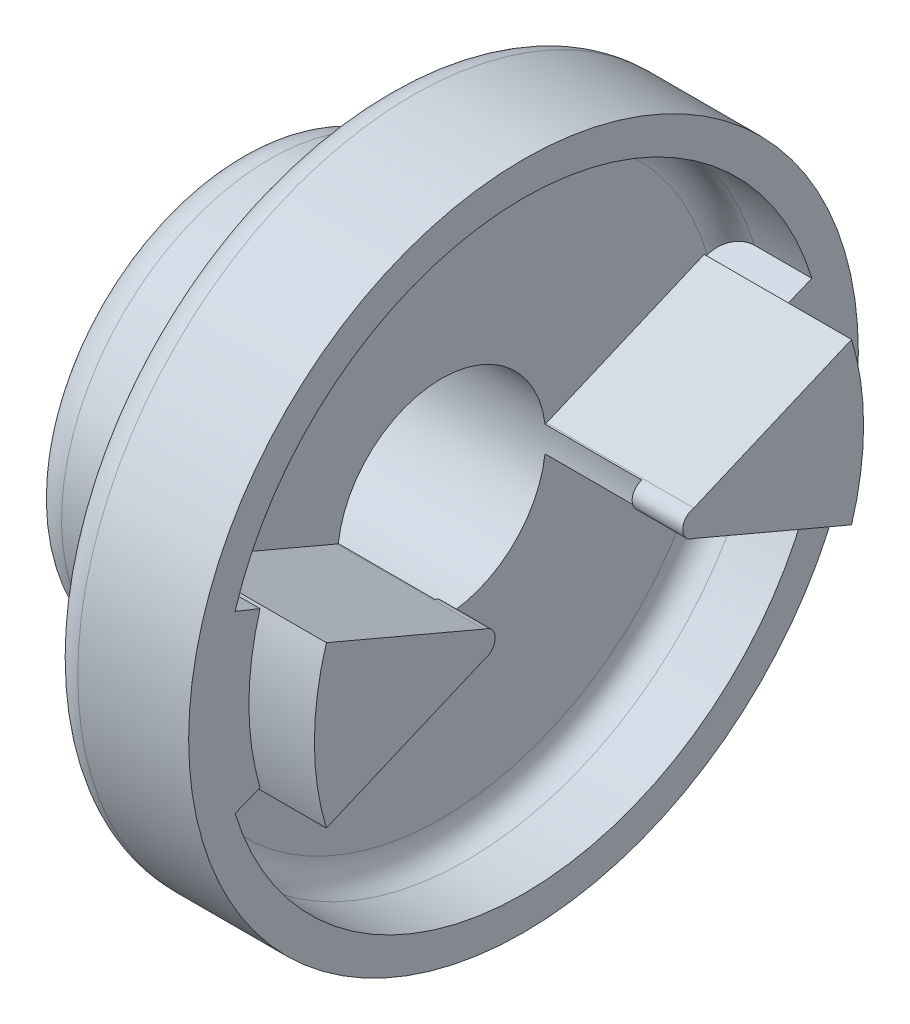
ISO-10303-21;
HEADER;
FILE_DESCRIPTION(('STEP AP214'),'2;1');
FILE_NAME('part.step','',(''),(''),'','','');
FILE_SCHEMA(('AUTOMOTIVE_DESIGN { 1 0 10303 214 1 1 1 1 }'));
ENDSEC;
DATA;
#1=APPLICATION_CONTEXT('core data for automotive mechanical design processes');
#2=APPLICATION_PROTOCOL_DEFINITION('international standard','automotive_design',2000,#1);
#3=PRODUCT_CONTEXT('',#1,'mechanical');
#4=PRODUCT('Part','Part','',(#3));
#5=PRODUCT_RELATED_PRODUCT_CATEGORY('part','',(#4));
#6=PRODUCT_DEFINITION_FORMATION('','',#4);
#7=PRODUCT_DEFINITION_CONTEXT('part definition',#1,'design');
#8=PRODUCT_DEFINITION('design','',#6,#7);
#9=PRODUCT_DEFINITION_SHAPE('','',#8);
#10=(LENGTH_UNIT() NAMED_UNIT(*) SI_UNIT(.MILLI.,.METRE.));
#11=(NAMED_UNIT(*) PLANE_ANGLE_UNIT() SI_UNIT($,.RADIAN.));
#12=(NAMED_UNIT(*) SI_UNIT($,.STERADIAN.) SOLID_ANGLE_UNIT());
#13=UNCERTAINTY_MEASURE_WITH_UNIT(LENGTH_MEASURE(1.E-05),#10,'distance_accuracy_value','');
#14=(GEOMETRIC_REPRESENTATION_CONTEXT(3) GLOBAL_UNCERTAINTY_ASSIGNED_CONTEXT((#13)) GLOBAL_UNIT_ASSIGNED_CONTEXT((#10,
#11,#12)) REPRESENTATION_CONTEXT('',''));
#15=CARTESIAN_POINT('',(0.,0.,0.));
#16=DIRECTION('',(0.,0.,1.));
#17=DIRECTION('',(1.,0.,0.));
#18=AXIS2_PLACEMENT_3D('',#15,#16,#17);
#19=CARTESIAN_POINT('',(-20.5,0.,5.77));
#20=DIRECTION('',(-1.,0.,0.));
#21=DIRECTION('',(0.,0.,1.));
#22=AXIS2_PLACEMENT_3D('',#19,#20,#21);
#23=PLANE('',#22);
#24=CARTESIAN_POINT('',(-20.5,0.,0.));
#25=DIRECTION('',(1.,0.,0.));
#26=DIRECTION('',(0.,0.,-1.));
#27=AXIS2_PLACEMENT_3D('',#24,#25,#26);
#28=CIRCLE('',#27,7.);
#29=CARTESIAN_POINT('',(-20.5,0.,-7.));
#30=VERTEX_POINT('',#29);
#31=EDGE_CURVE('E214',#30,#30,#28,.T.);
#32=ORIENTED_EDGE('',*,*,#31,.T.);
#33=EDGE_LOOP('',(#32));
#34=FACE_BOUND('',#33,.T.);
#35=CARTESIAN_POINT('',(-20.5,0.,0.));
#36=DIRECTION('',(1.,0.,0.));
#37=DIRECTION('',(0.,-1.,0.));
#38=AXIS2_PLACEMENT_3D('',#35,#36,#37);
#39=CIRCLE('',#38,11.54);
#40=CARTESIAN_POINT('',(-20.5,-11.54,0.));
#41=VERTEX_POINT('',#40);
#42=CARTESIAN_POINT('',(-20.5,11.54,0.));
#43=VERTEX_POINT('',#42);
#44=EDGE_CURVE('E390',#41,#43,#39,.T.);
#45=ORIENTED_EDGE('',*,*,#44,.F.);
#46=CARTESIAN_POINT('',(-20.5,0.,0.));
#47=DIRECTION('',(1.,0.,0.));
#48=DIRECTION('',(0.,0.,1.));
#49=AXIS2_PLACEMENT_3D('',#46,#47,#48);
#50=CIRCLE('',#49,11.54);
#51=CARTESIAN_POINT('',(-20.5,0.,11.54));
#52=VERTEX_POINT('',#51);
#53=EDGE_CURVE('E189',#52,#41,#50,.T.);
#54=ORIENTED_EDGE('',*,*,#53,.F.);
#55=CARTESIAN_POINT('',(-20.5,0.,0.));
#56=DIRECTION('',(1.,0.,0.));
#57=DIRECTION('',(0.,1.,0.));
#58=AXIS2_PLACEMENT_3D('',#55,#56,#57);
#59=CIRCLE('',#58,11.54);
#60=EDGE_CURVE('E393',#43,#52,#59,.T.);
#61=ORIENTED_EDGE('',*,*,#60,.F.);
#62=EDGE_LOOP('',(#45,#54,#61));
#63=FACE_BOUND('',#62,.T.);
#64=ADVANCED_FACE('F16',(#34,#63),#23,.T.);
#65=CARTESIAN_POINT('',(-18.04,0.,0.));
#66=DIRECTION('',(-1.,0.,0.));
#67=DIRECTION('',(0.,-1.,0.));
#68=AXIS2_PLACEMENT_3D('',#65,#66,#67);
#69=TOROIDAL_SURFACE('',#68,11.54,2.46);
#70=CARTESIAN_POINT('',(-18.04,0.,0.));
#71=DIRECTION('',(-1.,0.,0.));
#72=DIRECTION('',(0.,-1.,0.));
#73=AXIS2_PLACEMENT_3D('',#70,#71,#72);
#74=CIRCLE('',#73,14.);
#75=CARTESIAN_POINT('',(-18.04,-14.,0.));
#76=VERTEX_POINT('',#75);
#77=EDGE_CURVE('E211',#76,#76,#74,.F.);
#78=ORIENTED_EDGE('',*,*,#77,.F.);
#79=EDGE_LOOP('',(#78));
#80=FACE_BOUND('',#79,.T.);
#81=ORIENTED_EDGE('',*,*,#60,.T.);
#82=ORIENTED_EDGE('',*,*,#53,.T.);
#83=ORIENTED_EDGE('',*,*,#44,.T.);
#84=EDGE_LOOP('',(#81,#82,#83));
#85=FACE_BOUND('',#84,.T.);
#86=ADVANCED_FACE('F226',(#80,#85),#69,.T.);
#87=CARTESIAN_POINT('',(0.,0.,0.));
#88=DIRECTION('',(1.,0.,0.));
#89=DIRECTION('',(0.,0.,-1.));
#90=AXIS2_PLACEMENT_3D('',#87,#88,#89);
#91=PLANE('',#90);
#92=CARTESIAN_POINT('',(0.,0.,0.));
#93=DIRECTION('',(1.,0.,0.));
#94=DIRECTION('',(0.,0.,-1.));
#95=AXIS2_PLACEMENT_3D('',#92,#93,#94);
#96=CIRCLE('',#95,7.);
#97=CARTESIAN_POINT('',(0.,-0.863569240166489,6.94652777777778));
#98=VERTEX_POINT('',#97);
#99=CARTESIAN_POINT('',(0.,0.863569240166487,6.94652777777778));
#100=VERTEX_POINT('',#99);
#101=EDGE_CURVE('E188',#98,#100,#96,.F.);
#102=ORIENTED_EDGE('',*,*,#101,.T.);
#103=CARTESIAN_POINT('',(0.,0.,7.2));
#104=DIRECTION('',(-1.,0.,0.));
#105=DIRECTION('',(0.,-1.,0.));
#106=AXIS2_PLACEMENT_3D('',#103,#104,#105);
#107=CIRCLE('',#106,0.9);
#108=EDGE_CURVE('E580',#98,#100,#107,.F.);
#109=ORIENTED_EDGE('',*,*,#108,.F.);
#110=EDGE_LOOP('',(#102,#109));
#111=FACE_BOUND('',#110,.T.);
#112=ADVANCED_FACE('F237',(#111),#91,.F.);
#113=CARTESIAN_POINT('',(0.,0.,0.));
#114=DIRECTION('',(1.,0.,0.));
#115=DIRECTION('',(0.,0.,-1.));
#116=AXIS2_PLACEMENT_3D('',#113,#114,#115);
#117=PLANE('',#116);
#118=CARTESIAN_POINT('',(0.,0.,-7.2));
#119=DIRECTION('',(-1.,0.,0.));
#120=DIRECTION('',(0.,-1.,0.));
#121=AXIS2_PLACEMENT_3D('',#118,#119,#120);
#122=CIRCLE('',#121,0.9);
#123=CARTESIAN_POINT('',(0.,0.86356924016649,-6.94652777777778));
#124=VERTEX_POINT('',#123);
#125=CARTESIAN_POINT('',(0.,-0.863569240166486,-6.94652777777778));
#126=VERTEX_POINT('',#125);
#127=EDGE_CURVE('E191',#124,#126,#122,.F.);
#128=ORIENTED_EDGE('',*,*,#127,.F.);
#129=CARTESIAN_POINT('',(0.,0.,0.));
#130=DIRECTION('',(1.,0.,0.));
#131=DIRECTION('',(0.,0.,-1.));
#132=AXIS2_PLACEMENT_3D('',#129,#130,#131);
#133=CIRCLE('',#132,7.);
#134=EDGE_CURVE('E177',#124,#126,#133,.F.);
#135=ORIENTED_EDGE('',*,*,#134,.T.);
#136=EDGE_LOOP('',(#128,#135));
#137=FACE_BOUND('',#136,.T.);
#138=ADVANCED_FACE('F192',(#137),#117,.F.);
#139=CARTESIAN_POINT('',(-12.3,0.,0.));
#140=DIRECTION('',(1.,0.,0.));
#141=DIRECTION('',(0.,0.,-1.));
#142=AXIS2_PLACEMENT_3D('',#139,#140,#141);
#143=CYLINDRICAL_SURFACE('',#142,7.);
#144=ORIENTED_EDGE('',*,*,#31,.F.);
#145=EDGE_LOOP('',(#144));
#146=FACE_BOUND('',#145,.T.);
#147=DIRECTION('',(-1.,0.,0.));
#148=VECTOR('',#147,1.);
#149=CARTESIAN_POINT('',(3.4,0.863569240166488,6.94652777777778));
#150=LINE('',#149,#148);
#151=CARTESIAN_POINT('',(-6.5,0.863569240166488,6.94652777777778));
#152=VERTEX_POINT('',#151);
#153=EDGE_CURVE('E208',#100,#152,#150,.T.);
#154=ORIENTED_EDGE('',*,*,#153,.F.);
#155=ORIENTED_EDGE('',*,*,#101,.F.);
#156=DIRECTION('',(-1.,0.,0.));
#157=VECTOR('',#156,1.);
#158=CARTESIAN_POINT('',(3.4,-0.863569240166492,6.94652777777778));
#159=LINE('',#158,#157);
#160=CARTESIAN_POINT('',(-6.5,-0.86356924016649,6.94652777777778));
#161=VERTEX_POINT('',#160);
#162=EDGE_CURVE('E206',#161,#98,#159,.F.);
#163=ORIENTED_EDGE('',*,*,#162,.F.);
#164=CARTESIAN_POINT('',(-6.5,0.,0.));
#165=DIRECTION('',(1.,0.,0.));
#166=DIRECTION('',(0.,0.,-1.));
#167=AXIS2_PLACEMENT_3D('',#164,#165,#166);
#168=CIRCLE('',#167,7.);
#169=CARTESIAN_POINT('',(-6.5,-0.863569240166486,-6.94652777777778));
#170=VERTEX_POINT('',#169);
#171=EDGE_CURVE('E568',#170,#161,#168,.F.);
#172=ORIENTED_EDGE('',*,*,#171,.F.);
#173=DIRECTION('',(-1.,0.,0.));
#174=VECTOR('',#173,1.);
#175=CARTESIAN_POINT('',(3.4,-0.863569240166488,-6.94652777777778));
#176=LINE('',#175,#174);
#177=EDGE_CURVE('E185',#126,#170,#176,.T.);
#178=ORIENTED_EDGE('',*,*,#177,.F.);
#179=ORIENTED_EDGE('',*,*,#134,.F.);
#180=DIRECTION('',(-1.,0.,0.));
#181=VECTOR('',#180,1.);
#182=CARTESIAN_POINT('',(3.4,0.863569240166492,-6.94652777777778));
#183=LINE('',#182,#181);
#184=CARTESIAN_POINT('',(-6.5,0.863569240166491,-6.94652777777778));
#185=VERTEX_POINT('',#184);
#186=EDGE_CURVE('E182',#185,#124,#183,.F.);
#187=ORIENTED_EDGE('',*,*,#186,.F.);
#188=CARTESIAN_POINT('',(-6.5,0.,0.));
#189=DIRECTION('',(1.,0.,0.));
#190=DIRECTION('',(0.,0.,-1.));
#191=AXIS2_PLACEMENT_3D('',#188,#189,#190);
#192=CIRCLE('',#191,7.);
#193=EDGE_CURVE('E578',#152,#185,#192,.F.);
#194=ORIENTED_EDGE('',*,*,#193,.F.);
#195=EDGE_LOOP('',(#154,#155,#163,#172,#178,#179,#187,#194));
#196=FACE_BOUND('',#195,.T.);
#197=ADVANCED_FACE('F180',(#146,#196),#143,.F.);
#198=CARTESIAN_POINT('',(-15.295,0.,0.));
#199=DIRECTION('',(-1.,0.,0.));
#200=DIRECTION('',(0.,-1.,0.));
#201=AXIS2_PLACEMENT_3D('',#198,#199,#200);
#202=CYLINDRICAL_SURFACE('',#201,14.);
#203=CARTESIAN_POINT('',(-12.55,0.,0.));
#204=DIRECTION('',(1.,0.,0.));
#205=DIRECTION('',(0.,1.,0.));
#206=AXIS2_PLACEMENT_3D('',#203,#204,#205);
#207=CIRCLE('',#206,14.);
#208=CARTESIAN_POINT('',(-12.55,14.,0.));
#209=VERTEX_POINT('',#208);
#210=EDGE_CURVE('E597',#209,#209,#207,.T.);
#211=ORIENTED_EDGE('',*,*,#210,.F.);
#212=EDGE_LOOP('',(#211));
#213=FACE_BOUND('',#212,.T.);
#214=ORIENTED_EDGE('',*,*,#77,.T.);
#215=EDGE_LOOP('',(#214));
#216=FACE_BOUND('',#215,.T.);
#217=ADVANCED_FACE('F649',(#213,#216),#202,.T.);
#218=CARTESIAN_POINT('',(3.4,0.,7.2));
#219=DIRECTION('',(-1.,0.,0.));
#220=DIRECTION('',(0.,-1.,0.));
#221=AXIS2_PLACEMENT_3D('',#218,#219,#220);
#222=CYLINDRICAL_SURFACE('',#221,0.9);
#223=ORIENTED_EDGE('',*,*,#162,.T.);
#224=ORIENTED_EDGE('',*,*,#108,.T.);
#225=ORIENTED_EDGE('',*,*,#153,.T.);
#226=CARTESIAN_POINT('',(-6.5,0.,7.2));
#227=DIRECTION('',(-1.,0.,0.));
#228=DIRECTION('',(0.,-1.,0.));
#229=AXIS2_PLACEMENT_3D('',#226,#227,#228);
#230=CIRCLE('',#229,0.9);
#231=CARTESIAN_POINT('',(-6.5,0.886326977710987,7.04371664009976));
#232=VERTEX_POINT('',#231);
#233=EDGE_CURVE('E199',#232,#152,#230,.T.);
#234=ORIENTED_EDGE('',*,*,#233,.F.);
#235=DIRECTION('',(1.,0.,0.));
#236=VECTOR('',#235,1.);
#237=CARTESIAN_POINT('',(3.4,0.886326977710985,7.04371664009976));
#238=LINE('',#237,#236);
#239=CARTESIAN_POINT('',(3.4,0.886326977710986,7.04371664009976));
#240=VERTEX_POINT('',#239);
#241=EDGE_CURVE('E605',#240,#232,#238,.F.);
#242=ORIENTED_EDGE('',*,*,#241,.F.);
#243=CARTESIAN_POINT('',(3.4,0.,7.2));
#244=DIRECTION('',(-1.,0.,0.));
#245=DIRECTION('',(0.,-1.,0.));
#246=AXIS2_PLACEMENT_3D('',#243,#244,#245);
#247=CIRCLE('',#246,0.9);
#248=CARTESIAN_POINT('',(3.4,-0.886326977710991,7.04371664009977));
#249=VERTEX_POINT('',#248);
#250=EDGE_CURVE('E266',#240,#249,#247,.T.);
#251=ORIENTED_EDGE('',*,*,#250,.T.);
#252=DIRECTION('',(1.,0.,0.));
#253=VECTOR('',#252,1.);
#254=CARTESIAN_POINT('',(3.4,-0.886326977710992,7.04371664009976));
#255=LINE('',#254,#253);
#256=CARTESIAN_POINT('',(-6.5,-0.886326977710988,7.04371664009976));
#257=VERTEX_POINT('',#256);
#258=EDGE_CURVE('E602',#257,#249,#255,.T.);
#259=ORIENTED_EDGE('',*,*,#258,.F.);
#260=CARTESIAN_POINT('',(-6.5,0.,7.2));
#261=DIRECTION('',(-1.,0.,0.));
#262=DIRECTION('',(0.,-1.,0.));
#263=AXIS2_PLACEMENT_3D('',#260,#261,#262);
#264=CIRCLE('',#263,0.9);
#265=EDGE_CURVE('E566',#161,#257,#264,.T.);
#266=ORIENTED_EDGE('',*,*,#265,.F.);
#267=EDGE_LOOP('',(#223,#224,#225,#234,#242,#251,#259,#266));
#268=FACE_BOUND('',#267,.T.);
#269=ADVANCED_FACE('F589',(#268),#222,.T.);
#270=CARTESIAN_POINT('',(-6.5,0.,9.305));
#271=DIRECTION('',(1.,0.,0.));
#272=DIRECTION('',(0.,0.,-1.));
#273=AXIS2_PLACEMENT_3D('',#270,#271,#272);
#274=PLANE('',#273);
#275=DIRECTION('',(0.,0.391352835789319,0.920240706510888));
#276=VECTOR('',#275,1.);
#277=CARTESIAN_POINT('',(-6.5,0.886326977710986,7.04371664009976));
#278=LINE('',#277,#276);
#279=CARTESIAN_POINT('',(-6.5,5.3942579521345,17.643822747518));
#280=VERTEX_POINT('',#279);
#281=EDGE_CURVE('E265',#232,#280,#278,.T.);
#282=ORIENTED_EDGE('',*,*,#281,.F.);
#283=ORIENTED_EDGE('',*,*,#233,.T.);
#284=ORIENTED_EDGE('',*,*,#193,.T.);
#285=CARTESIAN_POINT('',(-6.5,0.,-7.2));
#286=DIRECTION('',(-1.,0.,0.));
#287=DIRECTION('',(0.,-1.,0.));
#288=AXIS2_PLACEMENT_3D('',#285,#286,#287);
#289=CIRCLE('',#288,0.9);
#290=CARTESIAN_POINT('',(-6.5,0.88632697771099,-7.04371664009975));
#291=VERTEX_POINT('',#290);
#292=EDGE_CURVE('E198',#291,#185,#289,.F.);
#293=ORIENTED_EDGE('',*,*,#292,.F.);
#294=DIRECTION('',(0.,-0.391352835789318,0.920240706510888));
#295=VECTOR('',#294,1.);
#296=CARTESIAN_POINT('',(-6.5,5.3942579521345,-17.643822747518));
#297=LINE('',#296,#295);
#298=CARTESIAN_POINT('',(-6.5,5.3942579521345,-17.643822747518));
#299=VERTEX_POINT('',#298);
#300=EDGE_CURVE('E604',#299,#291,#297,.T.);
#301=ORIENTED_EDGE('',*,*,#300,.F.);
#302=CARTESIAN_POINT('',(-6.5,0.,0.));
#303=DIRECTION('',(1.,0.,0.));
#304=DIRECTION('',(0.,0.,-1.));
#305=AXIS2_PLACEMENT_3D('',#302,#303,#304);
#306=CIRCLE('',#305,18.45);
#307=CARTESIAN_POINT('',(-6.5,5.20360193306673,-17.7009894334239));
#308=VERTEX_POINT('',#307);
#309=EDGE_CURVE('E254',#299,#308,#306,.F.);
#310=ORIENTED_EDGE('',*,*,#309,.T.);
#311=DIRECTION('',(0.,0.375463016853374,-0.926837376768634));
#312=VECTOR('',#311,1.);
#313=CARTESIAN_POINT('',(-6.5,5.20360193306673,-17.7009894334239));
#314=LINE('',#313,#312);
#315=CARTESIAN_POINT('',(-6.5,5.26396892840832,-17.8500064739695));
#316=VERTEX_POINT('',#315);
#317=EDGE_CURVE('E252',#308,#316,#314,.T.);
#318=ORIENTED_EDGE('',*,*,#317,.T.);
#319=CARTESIAN_POINT('',(-6.49999999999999,0.,0.));
#320=DIRECTION('',(-1.,0.,0.));
#321=DIRECTION('',(0.,-1.,0.));
#322=AXIS2_PLACEMENT_3D('',#319,#320,#321);
#323=CIRCLE('',#322,18.61);
#324=CARTESIAN_POINT('',(-6.5,5.26396892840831,17.8500064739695));
#325=VERTEX_POINT('',#324);
#326=EDGE_CURVE('E517',#325,#316,#323,.T.);
#327=ORIENTED_EDGE('',*,*,#326,.F.);
#328=DIRECTION('',(0.,-0.37546301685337,-0.926837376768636));
#329=VECTOR('',#328,1.);
#330=CARTESIAN_POINT('',(-6.5,5.26396892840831,17.8500064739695));
#331=LINE('',#330,#329);
#332=CARTESIAN_POINT('',(-6.5,5.20360193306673,17.7009894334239));
#333=VERTEX_POINT('',#332);
#334=EDGE_CURVE('E249',#325,#333,#331,.T.);
#335=ORIENTED_EDGE('',*,*,#334,.T.);
#336=CARTESIAN_POINT('',(-6.5,0.,0.));
#337=DIRECTION('',(1.,0.,0.));
#338=DIRECTION('',(0.,0.,-1.));
#339=AXIS2_PLACEMENT_3D('',#336,#337,#338);
#340=CIRCLE('',#339,18.45);
#341=EDGE_CURVE('E202',#333,#280,#340,.F.);
#342=ORIENTED_EDGE('',*,*,#341,.T.);
#343=EDGE_LOOP('',(#282,#283,#284,#293,#301,#310,#318,#327,#335,#342));
#344=FACE_BOUND('',#343,.T.);
#345=ADVANCED_FACE('F642',(#344),#274,.T.);
#346=CARTESIAN_POINT('',(3.4,0.,-7.2));
#347=DIRECTION('',(-1.,0.,0.));
#348=DIRECTION('',(0.,-1.,0.));
#349=AXIS2_PLACEMENT_3D('',#346,#347,#348);
#350=CYLINDRICAL_SURFACE('',#349,0.9);
#351=DIRECTION('',(1.,0.,0.));
#352=VECTOR('',#351,1.);
#353=CARTESIAN_POINT('',(3.4,0.886326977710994,-7.04371664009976));
#354=LINE('',#353,#352);
#355=CARTESIAN_POINT('',(3.4,0.886326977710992,-7.04371664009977));
#356=VERTEX_POINT('',#355);
#357=EDGE_CURVE('E606',#291,#356,#354,.T.);
#358=ORIENTED_EDGE('',*,*,#357,.F.);
#359=ORIENTED_EDGE('',*,*,#292,.T.);
#360=ORIENTED_EDGE('',*,*,#186,.T.);
#361=ORIENTED_EDGE('',*,*,#127,.T.);
#362=ORIENTED_EDGE('',*,*,#177,.T.);
#363=CARTESIAN_POINT('',(-6.5,0.,-7.2));
#364=DIRECTION('',(-1.,0.,0.));
#365=DIRECTION('',(0.,-1.,0.));
#366=AXIS2_PLACEMENT_3D('',#363,#364,#365);
#367=CIRCLE('',#366,0.9);
#368=CARTESIAN_POINT('',(-6.5,-0.886326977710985,-7.04371664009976));
#369=VERTEX_POINT('',#368);
#370=EDGE_CURVE('E594',#369,#170,#367,.T.);
#371=ORIENTED_EDGE('',*,*,#370,.F.);
#372=DIRECTION('',(1.,0.,0.));
#373=VECTOR('',#372,1.);
#374=CARTESIAN_POINT('',(3.4,-0.886326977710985,-7.04371664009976));
#375=LINE('',#374,#373);
#376=CARTESIAN_POINT('',(3.4,-0.886326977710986,-7.04371664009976));
#377=VERTEX_POINT('',#376);
#378=EDGE_CURVE('E607',#377,#369,#375,.F.);
#379=ORIENTED_EDGE('',*,*,#378,.F.);
#380=CARTESIAN_POINT('',(3.4,0.,-7.2));
#381=DIRECTION('',(-1.,0.,0.));
#382=DIRECTION('',(0.,-1.,0.));
#383=AXIS2_PLACEMENT_3D('',#380,#381,#382);
#384=CIRCLE('',#383,0.9);
#385=EDGE_CURVE('E270',#377,#356,#384,.T.);
#386=ORIENTED_EDGE('',*,*,#385,.T.);
#387=EDGE_LOOP('',(#358,#359,#360,#361,#362,#371,#379,#386));
#388=FACE_BOUND('',#387,.T.);
#389=ADVANCED_FACE('F197',(#388),#350,.T.);
#390=CARTESIAN_POINT('',(-6.5,0.,9.305));
#391=DIRECTION('',(1.,0.,0.));
#392=DIRECTION('',(0.,0.,-1.));
#393=AXIS2_PLACEMENT_3D('',#390,#391,#392);
#394=PLANE('',#393);
#395=DIRECTION('',(0.,-0.391352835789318,-0.920240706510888));
#396=VECTOR('',#395,1.);
#397=CARTESIAN_POINT('',(-6.5,-0.886326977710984,-7.04371664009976));
#398=LINE('',#397,#396);
#399=CARTESIAN_POINT('',(-6.5,-5.39425795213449,-17.643822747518));
#400=VERTEX_POINT('',#399);
#401=EDGE_CURVE('E269',#369,#400,#398,.T.);
#402=ORIENTED_EDGE('',*,*,#401,.F.);
#403=ORIENTED_EDGE('',*,*,#370,.T.);
#404=ORIENTED_EDGE('',*,*,#171,.T.);
#405=ORIENTED_EDGE('',*,*,#265,.T.);
#406=DIRECTION('',(0.,0.391352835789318,-0.920240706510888));
#407=VECTOR('',#406,1.);
#408=CARTESIAN_POINT('',(-6.5,-5.39425795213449,17.643822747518));
#409=LINE('',#408,#407);
#410=CARTESIAN_POINT('',(-6.5,-5.39425795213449,17.643822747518));
#411=VERTEX_POINT('',#410);
#412=EDGE_CURVE('E563',#411,#257,#409,.T.);
#413=ORIENTED_EDGE('',*,*,#412,.F.);
#414=CARTESIAN_POINT('',(-6.5,0.,0.));
#415=DIRECTION('',(1.,0.,0.));
#416=DIRECTION('',(0.,0.,-1.));
#417=AXIS2_PLACEMENT_3D('',#414,#415,#416);
#418=CIRCLE('',#417,18.45);
#419=CARTESIAN_POINT('',(-6.5,-5.20360193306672,17.7009894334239));
#420=VERTEX_POINT('',#419);
#421=EDGE_CURVE('E262',#411,#420,#418,.F.);
#422=ORIENTED_EDGE('',*,*,#421,.T.);
#423=DIRECTION('',(0.,-0.375463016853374,0.926837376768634));
#424=VECTOR('',#423,1.);
#425=CARTESIAN_POINT('',(-6.5,-5.20360193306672,17.7009894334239));
#426=LINE('',#425,#424);
#427=CARTESIAN_POINT('',(-6.5,-5.26396892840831,17.8500064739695));
#428=VERTEX_POINT('',#427);
#429=EDGE_CURVE('E259',#420,#428,#426,.T.);
#430=ORIENTED_EDGE('',*,*,#429,.T.);
#431=CARTESIAN_POINT('',(-6.5,0.,0.));
#432=DIRECTION('',(-1.,0.,0.));
#433=DIRECTION('',(0.,-1.,0.));
#434=AXIS2_PLACEMENT_3D('',#431,#432,#433);
#435=CIRCLE('',#434,18.61);
#436=CARTESIAN_POINT('',(-6.5,-5.26396892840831,-17.8500064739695));
#437=VERTEX_POINT('',#436);
#438=EDGE_CURVE('E315',#437,#428,#435,.T.);
#439=ORIENTED_EDGE('',*,*,#438,.F.);
#440=DIRECTION('',(0.,0.37546301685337,0.926837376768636));
#441=VECTOR('',#440,1.);
#442=CARTESIAN_POINT('',(-6.5,-5.26396892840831,-17.8500064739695));
#443=LINE('',#442,#441);
#444=CARTESIAN_POINT('',(-6.5,-5.20360193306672,-17.7009894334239));
#445=VERTEX_POINT('',#444);
#446=EDGE_CURVE('E255',#437,#445,#443,.T.);
#447=ORIENTED_EDGE('',*,*,#446,.T.);
#448=CARTESIAN_POINT('',(-6.5,0.,0.));
#449=DIRECTION('',(1.,0.,0.));
#450=DIRECTION('',(0.,0.,-1.));
#451=AXIS2_PLACEMENT_3D('',#448,#449,#450);
#452=CIRCLE('',#451,18.45);
#453=EDGE_CURVE('E258',#445,#400,#452,.F.);
#454=ORIENTED_EDGE('',*,*,#453,.T.);
#455=EDGE_LOOP('',(#402,#403,#404,#405,#413,#422,#430,#439,#447,#454));
#456=FACE_BOUND('',#455,.T.);
#457=ADVANCED_FACE('F478',(#456),#394,.T.);
#458=CARTESIAN_POINT('',(-12.55,0.,0.));
#459=DIRECTION('',(-1.,0.,0.));
#460=DIRECTION('',(0.,-1.,0.));
#461=AXIS2_PLACEMENT_3D('',#458,#459,#460);
#462=TOROIDAL_SURFACE('',#461,16.05,2.05);
#463=CARTESIAN_POINT('',(-10.5,16.05,0.));
#464=CARTESIAN_POINT('',(-10.5,16.049951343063,1.47254158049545));
#465=CARTESIAN_POINT('',(-10.5,15.782051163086,2.92050699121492));
#466=CARTESIAN_POINT('',(-10.5,15.4980503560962,4.45549418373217));
#467=CARTESIAN_POINT('',(-10.5,14.923102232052,5.90792008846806));
#468=CARTESIAN_POINT('',(-10.5,14.3244040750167,7.42034299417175));
#469=CARTESIAN_POINT('',(-10.5,13.4337779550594,8.78271654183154));
#470=CARTESIAN_POINT('',(-10.5,12.5246371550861,10.1734116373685));
#471=CARTESIAN_POINT('',(-10.5,11.3490638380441,11.3490638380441));
#472=CARTESIAN_POINT('',(-10.5,10.1742479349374,12.5239585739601));
#473=CARTESIAN_POINT('',(-10.5,8.78271654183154,13.4337779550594));
#474=CARTESIAN_POINT('',(-10.5,7.42128005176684,14.3239205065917));
#475=CARTESIAN_POINT('',(-10.5,5.90792008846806,14.923102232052));
#476=CARTESIAN_POINT('',(-10.5,4.45650308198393,15.4977590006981));
#477=CARTESIAN_POINT('',(-10.5,2.92050699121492,15.782051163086));
#478=CARTESIAN_POINT('',(-10.5,1.47307488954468,16.0499513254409));
#479=CARTESIAN_POINT('',(-10.5,0.,16.05));
#480=B_SPLINE_CURVE_WITH_KNOTS('',2,(#463,#464,#465,#466,#467,#468,#469,#470,#471,#472,#473,
#474,#475,#476,#477,#478,#479),.UNSPECIFIED.,.F.,.F.,(3,2,2,2,2,2,2,2,3),(0.,0.125,0.25,0.375,
0.5,0.625,0.75,0.875,1.),.UNSPECIFIED.);
#481=CARTESIAN_POINT('',(-10.5,16.05,0.));
#482=VERTEX_POINT('',#481);
#483=CARTESIAN_POINT('',(-10.5,0.,16.05));
#484=VERTEX_POINT('',#483);
#485=EDGE_CURVE('E311',#482,#484,#480,.T.);
#486=ORIENTED_EDGE('',*,*,#485,.F.);
#487=CARTESIAN_POINT('',(-10.5,0.,0.));
#488=DIRECTION('',(-1.,0.,0.));
#489=DIRECTION('',(0.,-1.,0.));
#490=AXIS2_PLACEMENT_3D('',#487,#488,#489);
#491=CIRCLE('',#490,16.05);
#492=CARTESIAN_POINT('',(-10.5,-16.05,0.));
#493=VERTEX_POINT('',#492);
#494=EDGE_CURVE('E324',#493,#482,#491,.F.);
#495=ORIENTED_EDGE('',*,*,#494,.F.);
#496=CARTESIAN_POINT('',(-10.5,0.,16.05));
#497=CARTESIAN_POINT('',(-10.5,-1.47254158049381,16.0499513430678));
#498=CARTESIAN_POINT('',(-10.5,-2.92050699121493,15.782051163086));
#499=CARTESIAN_POINT('',(-10.5,-4.45549418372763,15.4980503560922));
#500=CARTESIAN_POINT('',(-10.5,-5.90792008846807,14.923102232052));
#501=CARTESIAN_POINT('',(-10.5,-7.42034299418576,14.3244040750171));
#502=CARTESIAN_POINT('',(-10.5,-8.78271654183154,13.4337779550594));
#503=CARTESIAN_POINT('',(-10.5,-10.1734116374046,12.5246371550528));
#504=CARTESIAN_POINT('',(-10.5,-11.3490638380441,11.3490638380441));
#505=CARTESIAN_POINT('',(-10.5,-12.5239585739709,10.1742479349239));
#506=CARTESIAN_POINT('',(-10.5,-13.4337779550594,8.78271654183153));
#507=CARTESIAN_POINT('',(-10.5,-14.3239205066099,7.4212800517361));
#508=CARTESIAN_POINT('',(-10.5,-14.923102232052,5.90792008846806));
#509=CARTESIAN_POINT('',(-10.5,-15.4977590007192,4.45650308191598));
#510=CARTESIAN_POINT('',(-10.5,-15.782051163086,2.92050699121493));
#511=CARTESIAN_POINT('',(-10.5,-16.0499513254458,1.47307488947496));
#512=CARTESIAN_POINT('',(-10.5,-16.05,0.));
#513=B_SPLINE_CURVE_WITH_KNOTS('',2,(#496,#497,#498,#499,#500,#501,#502,#503,#504,#505,#506,
#507,#508,#509,#510,#511,#512),.UNSPECIFIED.,.F.,.F.,(3,2,2,2,2,2,2,2,3),(0.,0.125,0.25,0.375,
0.5,0.625,0.75,0.875,1.),.UNSPECIFIED.);
#514=EDGE_CURVE('E314',#484,#493,#513,.T.);
#515=ORIENTED_EDGE('',*,*,#514,.F.);
#516=EDGE_LOOP('',(#486,#495,#515));
#517=FACE_BOUND('',#516,.T.);
#518=ORIENTED_EDGE('',*,*,#210,.T.);
#519=EDGE_LOOP('',(#518));
#520=FACE_BOUND('',#519,.T.);
#521=ADVANCED_FACE('F474',(#517,#520),#462,.F.);
#522=CARTESIAN_POINT('',(3.4,-5.39425795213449,17.643822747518));
#523=DIRECTION('',(0.,-0.920240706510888,-0.391352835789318));
#524=DIRECTION('',(0.,0.391352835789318,-0.920240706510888));
#525=AXIS2_PLACEMENT_3D('',#522,#523,#524);
#526=PLANE('',#525);
#527=DIRECTION('',(0.,-0.391352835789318,0.920240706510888));
#528=VECTOR('',#527,1.);
#529=CARTESIAN_POINT('',(3.4,-0.886326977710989,7.04371664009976));
#530=LINE('',#529,#528);
#531=CARTESIAN_POINT('',(3.4,-5.39425795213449,17.643822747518));
#532=VERTEX_POINT('',#531);
#533=EDGE_CURVE('E263',#249,#532,#530,.T.);
#534=ORIENTED_EDGE('',*,*,#533,.T.);
#535=DIRECTION('',(-1.,0.,0.));
#536=VECTOR('',#535,1.);
#537=CARTESIAN_POINT('',(3.4,-5.39425795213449,17.643822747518));
#538=LINE('',#537,#536);
#539=EDGE_CURVE('E488',#411,#532,#538,.F.);
#540=ORIENTED_EDGE('',*,*,#539,.F.);
#541=ORIENTED_EDGE('',*,*,#412,.T.);
#542=ORIENTED_EDGE('',*,*,#258,.T.);
#543=EDGE_LOOP('',(#534,#540,#541,#542));
#544=FACE_BOUND('',#543,.T.);
#545=ADVANCED_FACE('F477',(#544),#526,.T.);
#546=CARTESIAN_POINT('',(3.4,0.,13.6838296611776));
#547=DIRECTION('',(-1.,0.,0.));
#548=DIRECTION('',(0.,0.,1.));
#549=AXIS2_PLACEMENT_3D('',#546,#547,#548);
#550=PLANE('',#549);
#551=ORIENTED_EDGE('',*,*,#250,.F.);
#552=DIRECTION('',(0.,0.391352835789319,0.920240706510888));
#553=VECTOR('',#552,1.);
#554=CARTESIAN_POINT('',(3.4,0.886326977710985,7.04371664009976));
#555=LINE('',#554,#553);
#556=CARTESIAN_POINT('',(3.4,5.39425795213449,17.643822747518));
#557=VERTEX_POINT('',#556);
#558=EDGE_CURVE('E622',#557,#240,#555,.F.);
#559=ORIENTED_EDGE('',*,*,#558,.F.);
#560=CARTESIAN_POINT('',(3.4,0.,0.));
#561=DIRECTION('',(-1.,0.,0.));
#562=DIRECTION('',(0.,-1.,0.));
#563=AXIS2_PLACEMENT_3D('',#560,#561,#562);
#564=CIRCLE('',#563,18.45);
#565=EDGE_CURVE('E489',#532,#557,#564,.T.);
#566=ORIENTED_EDGE('',*,*,#565,.F.);
#567=ORIENTED_EDGE('',*,*,#533,.F.);
#568=EDGE_LOOP('',(#551,#559,#566,#567));
#569=FACE_BOUND('',#568,.T.);
#570=ADVANCED_FACE('F640',(#569),#550,.F.);
#571=CARTESIAN_POINT('',(3.4,0.886326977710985,7.04371664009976));
#572=DIRECTION('',(0.,0.920240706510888,-0.391352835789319));
#573=DIRECTION('',(0.,0.391352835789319,0.920240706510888));
#574=AXIS2_PLACEMENT_3D('',#571,#572,#573);
#575=PLANE('',#574);
#576=ORIENTED_EDGE('',*,*,#558,.T.);
#577=ORIENTED_EDGE('',*,*,#241,.T.);
#578=ORIENTED_EDGE('',*,*,#281,.T.);
#579=DIRECTION('',(-1.,0.,0.));
#580=VECTOR('',#579,1.);
#581=CARTESIAN_POINT('',(3.4,5.39425795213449,17.643822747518));
#582=LINE('',#581,#580);
#583=EDGE_CURVE('E523',#557,#280,#582,.T.);
#584=ORIENTED_EDGE('',*,*,#583,.F.);
#585=EDGE_LOOP('',(#576,#577,#578,#584));
#586=FACE_BOUND('',#585,.T.);
#587=ADVANCED_FACE('F637',(#586),#575,.T.);
#588=CARTESIAN_POINT('',(-4.86,0.,0.));
#589=DIRECTION('',(-1.,0.,0.));
#590=DIRECTION('',(0.,-1.,0.));
#591=AXIS2_PLACEMENT_3D('',#588,#589,#590);
#592=TOROIDAL_SURFACE('',#591,18.61,1.64);
#593=CARTESIAN_POINT('',(-4.86,5.88246201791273,-19.3767680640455));
#594=CARTESIAN_POINT('',(-4.90600148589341,5.88246193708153,-19.3767678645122));
#595=CARTESIAN_POINT('',(-4.95198088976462,5.88173188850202,-19.3749657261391));
#596=CARTESIAN_POINT('',(-5.04360969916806,5.87881966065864,-19.3677768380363));
#597=CARTESIAN_POINT('',(-5.08925912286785,5.87663756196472,-19.3623902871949));
#598=CARTESIAN_POINT('',(-5.22513200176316,5.86793498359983,-19.3409078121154));
#599=CARTESIAN_POINT('',(-5.31444374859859,5.85925815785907,-19.3194889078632));
#600=CARTESIAN_POINT('',(-5.48791474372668,5.83640020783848,-19.2630636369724));
#601=CARTESIAN_POINT('',(-5.57207168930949,5.82221664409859,-19.2280512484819));
#602=CARTESIAN_POINT('',(-5.73286309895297,5.78875597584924,-19.1454529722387));
#603=CARTESIAN_POINT('',(-5.80949865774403,5.76947961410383,-19.0978689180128));
#604=CARTESIAN_POINT('',(-5.95321982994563,5.72634973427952,-18.9914020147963));
#605=CARTESIAN_POINT('',(-6.02028904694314,5.70248851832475,-18.9325001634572));
#606=CARTESIAN_POINT('',(-6.14286987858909,5.65088630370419,-18.8051191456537));
#607=CARTESIAN_POINT('',(-6.19837917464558,5.62314452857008,-18.7366380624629));
#608=CARTESIAN_POINT('',(-6.2964881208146,5.5644561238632,-18.591764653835));
#609=CARTESIAN_POINT('',(-6.33903430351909,5.53349690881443,-18.5153412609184));
#610=CARTESIAN_POINT('',(-6.40972490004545,5.46934902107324,-18.3569910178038));
#611=CARTESIAN_POINT('',(-6.43787674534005,5.43616150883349,-18.2750670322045));
#612=CARTESIAN_POINT('',(-6.47226133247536,5.3796504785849,-18.1355685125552));
#613=CARTESIAN_POINT('',(-6.48265761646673,5.35667163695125,-18.0788448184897));
#614=CARTESIAN_POINT('',(-6.49652621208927,5.31045456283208,-17.9647571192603));
#615=CARTESIAN_POINT('',(-6.50000839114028,5.28721674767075,-17.9073941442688));
#616=CARTESIAN_POINT('',(-6.49999999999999,5.26396892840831,-17.8500064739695));
#617=B_SPLINE_CURVE_WITH_KNOTS('',3,(#593,#594,#595,#596,#597,#598,#599,#600,#601,#602,#603,
#604,#605,#606,#607,#608,#609,#610,#611,#612,#613,#614,#615,#616),.UNSPECIFIED.,.F.,.F.,(4,2,2,
2,2,2,2,2,2,2,2,4),(0.,0.137919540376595,0.275831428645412,0.551170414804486,0.826631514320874,
1.10205246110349,1.37793993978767,1.65388270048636,1.9309486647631,2.20787144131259,
2.39374028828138,2.57934368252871),.UNSPECIFIED.);
#618=CARTESIAN_POINT('',(-4.86,5.88246201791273,-19.3767680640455));
#619=VERTEX_POINT('',#618);
#620=EDGE_CURVE('E338',#619,#316,#617,.T.);
#621=ORIENTED_EDGE('',*,*,#620,.F.);
#622=CARTESIAN_POINT('',(-4.86,0.,0.));
#623=DIRECTION('',(-1.,0.,0.));
#624=DIRECTION('',(0.,-1.,0.));
#625=AXIS2_PLACEMENT_3D('',#622,#623,#624);
#626=CIRCLE('',#625,20.25);
#627=CARTESIAN_POINT('',(-4.86,5.88246201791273,19.3767680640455));
#628=VERTEX_POINT('',#627);
#629=EDGE_CURVE('E518',#619,#628,#626,.F.);
#630=ORIENTED_EDGE('',*,*,#629,.T.);
#631=CARTESIAN_POINT('',(-6.49999999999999,5.26396892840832,17.8500064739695));
#632=CARTESIAN_POINT('',(-6.49999957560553,5.28142922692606,17.8931075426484));
#633=CARTESIAN_POINT('',(-6.49803980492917,5.29888120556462,17.9361880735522));
#634=CARTESIAN_POINT('',(-6.49021984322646,5.33366088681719,18.0220423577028));
#635=CARTESIAN_POINT('',(-6.48435978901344,5.35098859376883,18.0648161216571));
#636=CARTESIAN_POINT('',(-6.46097986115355,5.40257394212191,18.1921555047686));
#637=CARTESIAN_POINT('',(-6.43766009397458,5.43648696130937,18.2758704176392));
#638=CARTESIAN_POINT('',(-6.37617762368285,5.50236198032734,18.438484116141));
#639=CARTESIAN_POINT('',(-6.3380068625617,5.53432291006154,18.5173802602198));
#640=CARTESIAN_POINT('',(-6.24788696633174,5.59537484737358,18.6680880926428));
#641=CARTESIAN_POINT('',(-6.19594088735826,5.62446648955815,18.7399013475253));
#642=CARTESIAN_POINT('',(-6.0798673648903,5.67887622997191,18.8742127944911));
#643=CARTESIAN_POINT('',(-6.01576990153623,5.70420334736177,18.9367332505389));
#644=CARTESIAN_POINT('',(-5.87710079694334,5.75044237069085,19.0508751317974));
#645=CARTESIAN_POINT('',(-5.8025271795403,5.77135344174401,19.1024944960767));
#646=CARTESIAN_POINT('',(-5.64536837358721,5.8080688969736,19.1931272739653));
#647=CARTESIAN_POINT('',(-5.56281674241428,5.82389355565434,19.2321907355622));
#648=CARTESIAN_POINT('',(-5.39180958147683,5.85008440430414,19.2968433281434));
#649=CARTESIAN_POINT('',(-5.30335790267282,5.86045411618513,19.3224411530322));
#650=CARTESIAN_POINT('',(-5.15527297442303,5.8727714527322,19.3528467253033));
#651=CARTESIAN_POINT('',(-5.09659488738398,5.87640326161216,19.3618119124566));
#652=CARTESIAN_POINT('',(-4.97861965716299,5.88124813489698,19.3737715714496));
#653=CARTESIAN_POINT('',(-4.91932351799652,5.88246464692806,19.3767745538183));
#654=CARTESIAN_POINT('',(-4.86,5.88246201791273,19.3767680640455));
#655=B_SPLINE_CURVE_WITH_KNOTS('',3,(#631,#632,#633,#634,#635,#636,#637,#638,#639,#640,#641,
#642,#643,#644,#645,#646,#647,#648,#649,#650,#651,#652,#653,#654),.UNSPECIFIED.,.F.,.F.,(4,2,2,
2,2,2,2,2,2,2,2,4),(0.,0.139424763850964,0.278844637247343,0.557265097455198,0.835836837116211,
1.11434682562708,1.39217840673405,1.67006246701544,1.94682473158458,2.22340808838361,
2.4014912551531,2.57932004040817),.UNSPECIFIED.);
#656=EDGE_CURVE('E445',#325,#628,#655,.T.);
#657=ORIENTED_EDGE('',*,*,#656,.F.);
#658=ORIENTED_EDGE('',*,*,#326,.T.);
#659=EDGE_LOOP('',(#621,#630,#657,#658));
#660=FACE_BOUND('',#659,.T.);
#661=ADVANCED_FACE('F452',(#660),#592,.F.);
#662=CARTESIAN_POINT('',(3.4,5.3942579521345,-17.643822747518));
#663=DIRECTION('',(0.,0.920240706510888,0.391352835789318));
#664=DIRECTION('',(0.,-0.391352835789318,0.920240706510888));
#665=AXIS2_PLACEMENT_3D('',#662,#663,#664);
#666=PLANE('',#665);
#667=DIRECTION('',(0.,0.391352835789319,-0.920240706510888));
#668=VECTOR('',#667,1.);
#669=CARTESIAN_POINT('',(3.4,0.886326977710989,-7.04371664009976));
#670=LINE('',#669,#668);
#671=CARTESIAN_POINT('',(3.4,5.3942579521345,-17.643822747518));
#672=VERTEX_POINT('',#671);
#673=EDGE_CURVE('E267',#356,#672,#670,.T.);
#674=ORIENTED_EDGE('',*,*,#673,.T.);
#675=DIRECTION('',(-1.,0.,0.));
#676=VECTOR('',#675,1.);
#677=CARTESIAN_POINT('',(3.4,5.3942579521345,-17.643822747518));
#678=LINE('',#677,#676);
#679=EDGE_CURVE('E438',#299,#672,#678,.F.);
#680=ORIENTED_EDGE('',*,*,#679,.F.);
#681=ORIENTED_EDGE('',*,*,#300,.T.);
#682=ORIENTED_EDGE('',*,*,#357,.T.);
#683=EDGE_LOOP('',(#674,#680,#681,#682));
#684=FACE_BOUND('',#683,.T.);
#685=ADVANCED_FACE('F661',(#684),#666,.T.);
#686=CARTESIAN_POINT('',(3.4,0.,-13.6838296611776));
#687=DIRECTION('',(-1.,0.,0.));
#688=DIRECTION('',(0.,0.,1.));
#689=AXIS2_PLACEMENT_3D('',#686,#687,#688);
#690=PLANE('',#689);
#691=ORIENTED_EDGE('',*,*,#385,.F.);
#692=DIRECTION('',(0.,-0.391352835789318,-0.920240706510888));
#693=VECTOR('',#692,1.);
#694=CARTESIAN_POINT('',(3.4,-0.886326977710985,-7.04371664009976));
#695=LINE('',#694,#693);
#696=CARTESIAN_POINT('',(3.4,-5.39425795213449,-17.643822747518));
#697=VERTEX_POINT('',#696);
#698=EDGE_CURVE('E609',#697,#377,#695,.F.);
#699=ORIENTED_EDGE('',*,*,#698,.F.);
#700=CARTESIAN_POINT('',(3.4,0.,0.));
#701=DIRECTION('',(-1.,0.,0.));
#702=DIRECTION('',(0.,-1.,0.));
#703=AXIS2_PLACEMENT_3D('',#700,#701,#702);
#704=CIRCLE('',#703,18.45);
#705=EDGE_CURVE('E434',#672,#697,#704,.T.);
#706=ORIENTED_EDGE('',*,*,#705,.F.);
#707=ORIENTED_EDGE('',*,*,#673,.F.);
#708=EDGE_LOOP('',(#691,#699,#706,#707));
#709=FACE_BOUND('',#708,.T.);
#710=ADVANCED_FACE('F663',(#709),#690,.F.);
#711=CARTESIAN_POINT('',(3.4,-0.886326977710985,-7.04371664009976));
#712=DIRECTION('',(0.,-0.920240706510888,0.391352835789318));
#713=DIRECTION('',(0.,-0.391352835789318,-0.920240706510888));
#714=AXIS2_PLACEMENT_3D('',#711,#712,#713);
#715=PLANE('',#714);
#716=ORIENTED_EDGE('',*,*,#698,.T.);
#717=ORIENTED_EDGE('',*,*,#378,.T.);
#718=ORIENTED_EDGE('',*,*,#401,.T.);
#719=DIRECTION('',(-1.,0.,0.));
#720=VECTOR('',#719,1.);
#721=CARTESIAN_POINT('',(3.4,-5.39425795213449,-17.643822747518));
#722=LINE('',#721,#720);
#723=EDGE_CURVE('E437',#697,#400,#722,.T.);
#724=ORIENTED_EDGE('',*,*,#723,.F.);
#725=EDGE_LOOP('',(#716,#717,#718,#724));
#726=FACE_BOUND('',#725,.T.);
#727=ADVANCED_FACE('F296',(#726),#715,.T.);
#728=CARTESIAN_POINT('',(-4.86,0.,0.));
#729=DIRECTION('',(-1.,0.,0.));
#730=DIRECTION('',(0.,-1.,0.));
#731=AXIS2_PLACEMENT_3D('',#728,#729,#730);
#732=TOROIDAL_SURFACE('',#731,18.61,1.64);
#733=CARTESIAN_POINT('',(-6.5,-5.26396892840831,-17.8500064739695));
#734=CARTESIAN_POINT('',(-6.49999957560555,-5.28142922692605,-17.8931075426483));
#735=CARTESIAN_POINT('',(-6.49803980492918,-5.29888120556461,-17.9361880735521));
#736=CARTESIAN_POINT('',(-6.49021984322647,-5.33366088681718,-18.0220423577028));
#737=CARTESIAN_POINT('',(-6.48435978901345,-5.35098859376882,-18.0648161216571));
#738=CARTESIAN_POINT('',(-6.46097986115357,-5.4025739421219,-18.1921555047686));
#739=CARTESIAN_POINT('',(-6.43766009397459,-5.43648696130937,-18.2758704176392));
#740=CARTESIAN_POINT('',(-6.37617762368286,-5.50236198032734,-18.438484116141));
#741=CARTESIAN_POINT('',(-6.33800686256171,-5.53432291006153,-18.5173802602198));
#742=CARTESIAN_POINT('',(-6.24788696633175,-5.59537484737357,-18.6680880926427));
#743=CARTESIAN_POINT('',(-6.19594088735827,-5.62446648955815,-18.7399013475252));
#744=CARTESIAN_POINT('',(-6.07986736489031,-5.6788762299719,-18.8742127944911));
#745=CARTESIAN_POINT('',(-6.01576990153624,-5.70420334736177,-18.9367332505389));
#746=CARTESIAN_POINT('',(-5.87710079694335,-5.75044237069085,-19.0508751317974));
#747=CARTESIAN_POINT('',(-5.80252717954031,-5.77135344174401,-19.1024944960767));
#748=CARTESIAN_POINT('',(-5.64536837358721,-5.8080688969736,-19.1931272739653));
#749=CARTESIAN_POINT('',(-5.56281674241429,-5.82389355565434,-19.2321907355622));
#750=CARTESIAN_POINT('',(-5.39180958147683,-5.85008440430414,-19.2968433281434));
#751=CARTESIAN_POINT('',(-5.30335790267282,-5.86045411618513,-19.3224411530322));
#752=CARTESIAN_POINT('',(-5.15527297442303,-5.8727714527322,-19.3528467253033));
#753=CARTESIAN_POINT('',(-5.09659488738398,-5.87640326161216,-19.3618119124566));
#754=CARTESIAN_POINT('',(-4.97861965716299,-5.88124813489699,-19.3737715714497));
#755=CARTESIAN_POINT('',(-4.91932351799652,-5.88246464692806,-19.3767745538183));
#756=CARTESIAN_POINT('',(-4.86,-5.88246201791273,-19.3767680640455));
#757=B_SPLINE_CURVE_WITH_KNOTS('',3,(#733,#734,#735,#736,#737,#738,#739,#740,#741,#742,#743,
#744,#745,#746,#747,#748,#749,#750,#751,#752,#753,#754,#755,#756),.UNSPECIFIED.,.F.,.F.,(4,2,2,
2,2,2,2,2,2,2,2,4),(0.,0.139424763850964,0.278844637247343,0.557265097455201,0.835836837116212,
1.11434682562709,1.39217840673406,1.67006246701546,1.9468247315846,2.22340808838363,
2.40149125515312,2.57932004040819),.UNSPECIFIED.);
#758=CARTESIAN_POINT('',(-4.86,-5.88246201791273,-19.3767680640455));
#759=VERTEX_POINT('',#758);
#760=EDGE_CURVE('E421',#437,#759,#757,.T.);
#761=ORIENTED_EDGE('',*,*,#760,.F.);
#762=ORIENTED_EDGE('',*,*,#438,.T.);
#763=CARTESIAN_POINT('',(-4.86,-5.88246201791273,19.3767680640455));
#764=CARTESIAN_POINT('',(-4.90600148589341,-5.88246193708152,19.3767678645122));
#765=CARTESIAN_POINT('',(-4.95198088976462,-5.88173188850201,19.3749657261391));
#766=CARTESIAN_POINT('',(-5.04360969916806,-5.87881966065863,19.3677768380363));
#767=CARTESIAN_POINT('',(-5.08925912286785,-5.87663756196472,19.3623902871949));
#768=CARTESIAN_POINT('',(-5.22513200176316,-5.86793498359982,19.3409078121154));
#769=CARTESIAN_POINT('',(-5.31444374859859,-5.85925815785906,19.3194889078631));
#770=CARTESIAN_POINT('',(-5.48791474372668,-5.83640020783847,19.2630636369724));
#771=CARTESIAN_POINT('',(-5.5720716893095,-5.82221664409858,19.2280512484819));
#772=CARTESIAN_POINT('',(-5.73286309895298,-5.78875597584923,19.1454529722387));
#773=CARTESIAN_POINT('',(-5.80949865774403,-5.76947961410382,19.0978689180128));
#774=CARTESIAN_POINT('',(-5.95321982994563,-5.72634973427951,18.9914020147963));
#775=CARTESIAN_POINT('',(-6.02028904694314,-5.70248851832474,18.9325001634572));
#776=CARTESIAN_POINT('',(-6.1428698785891,-5.65088630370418,18.8051191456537));
#777=CARTESIAN_POINT('',(-6.19837917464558,-5.62314452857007,18.7366380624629));
#778=CARTESIAN_POINT('',(-6.29648812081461,-5.5644561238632,18.591764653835));
#779=CARTESIAN_POINT('',(-6.3390343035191,-5.53349690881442,18.5153412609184));
#780=CARTESIAN_POINT('',(-6.40972490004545,-5.46934902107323,18.3569910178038));
#781=CARTESIAN_POINT('',(-6.43787674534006,-5.43616150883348,18.2750670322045));
#782=CARTESIAN_POINT('',(-6.47226133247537,-5.37965047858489,18.1355685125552));
#783=CARTESIAN_POINT('',(-6.48265761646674,-5.35667163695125,18.0788448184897));
#784=CARTESIAN_POINT('',(-6.49652621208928,-5.31045456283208,17.9647571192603));
#785=CARTESIAN_POINT('',(-6.50000839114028,-5.28721674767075,17.9073941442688));
#786=CARTESIAN_POINT('',(-6.5,-5.26396892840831,17.8500064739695));
#787=B_SPLINE_CURVE_WITH_KNOTS('',3,(#763,#764,#765,#766,#767,#768,#769,#770,#771,#772,#773,
#774,#775,#776,#777,#778,#779,#780,#781,#782,#783,#784,#785,#786),.UNSPECIFIED.,.F.,.F.,(4,2,2,
2,2,2,2,2,2,2,2,4),(0.,0.137919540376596,0.275831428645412,0.551170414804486,0.826631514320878,
1.10205246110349,1.37793993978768,1.65388270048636,1.9309486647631,2.2078714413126,
2.39374028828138,2.5793436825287),.UNSPECIFIED.);
#788=CARTESIAN_POINT('',(-4.86,-5.88246201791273,19.3767680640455));
#789=VERTEX_POINT('',#788);
#790=EDGE_CURVE('E333',#789,#428,#787,.T.);
#791=ORIENTED_EDGE('',*,*,#790,.F.);
#792=CARTESIAN_POINT('',(-4.86,0.,0.));
#793=DIRECTION('',(-1.,0.,0.));
#794=DIRECTION('',(0.,-1.,0.));
#795=AXIS2_PLACEMENT_3D('',#792,#793,#794);
#796=CIRCLE('',#795,20.25);
#797=EDGE_CURVE('E334',#789,#759,#796,.F.);
#798=ORIENTED_EDGE('',*,*,#797,.T.);
#799=EDGE_LOOP('',(#761,#762,#791,#798));
#800=FACE_BOUND('',#799,.T.);
#801=ADVANCED_FACE('F18',(#800),#732,.F.);
#802=CARTESIAN_POINT('',(-10.5,0.,18.25));
#803=DIRECTION('',(-1.,0.,0.));
#804=DIRECTION('',(0.,0.,1.));
#805=AXIS2_PLACEMENT_3D('',#802,#803,#804);
#806=PLANE('',#805);
#807=ORIENTED_EDGE('',*,*,#514,.T.);
#808=ORIENTED_EDGE('',*,*,#494,.T.);
#809=ORIENTED_EDGE('',*,*,#485,.T.);
#810=EDGE_LOOP('',(#807,#808,#809));
#811=FACE_BOUND('',#810,.T.);
#812=CARTESIAN_POINT('',(-10.5,0.,0.));
#813=DIRECTION('',(1.,0.,0.));
#814=DIRECTION('',(0.,-1.,0.));
#815=AXIS2_PLACEMENT_3D('',#812,#813,#814);
#816=CIRCLE('',#815,20.45);
#817=CARTESIAN_POINT('',(-10.5,-20.45,0.));
#818=VERTEX_POINT('',#817);
#819=CARTESIAN_POINT('',(-10.5,20.45,0.));
#820=VERTEX_POINT('',#819);
#821=EDGE_CURVE('E419',#818,#820,#816,.T.);
#822=ORIENTED_EDGE('',*,*,#821,.F.);
#823=CARTESIAN_POINT('',(-10.5,0.,0.));
#824=DIRECTION('',(1.,0.,0.));
#825=DIRECTION('',(0.,0.,1.));
#826=AXIS2_PLACEMENT_3D('',#823,#824,#825);
#827=CIRCLE('',#826,20.45);
#828=CARTESIAN_POINT('',(-10.5,0.,20.45));
#829=VERTEX_POINT('',#828);
#830=EDGE_CURVE('E380',#829,#818,#827,.T.);
#831=ORIENTED_EDGE('',*,*,#830,.F.);
#832=CARTESIAN_POINT('',(-10.5,0.,0.));
#833=DIRECTION('',(1.,0.,0.));
#834=DIRECTION('',(0.,1.,0.));
#835=AXIS2_PLACEMENT_3D('',#832,#833,#834);
#836=CIRCLE('',#835,20.45);
#837=EDGE_CURVE('E277',#820,#829,#836,.T.);
#838=ORIENTED_EDGE('',*,*,#837,.F.);
#839=EDGE_LOOP('',(#822,#831,#838));
#840=FACE_BOUND('',#839,.T.);
#841=ADVANCED_FACE('F284',(#811,#840),#806,.T.);
#842=CARTESIAN_POINT('',(-2.93,0.,0.));
#843=DIRECTION('',(-1.,0.,0.));
#844=DIRECTION('',(0.,-1.,0.));
#845=AXIS2_PLACEMENT_3D('',#842,#843,#844);
#846=CYLINDRICAL_SURFACE('',#845,20.25);
#847=ORIENTED_EDGE('',*,*,#797,.F.);
#848=DIRECTION('',(1.,0.,0.));
#849=VECTOR('',#848,1.);
#850=CARTESIAN_POINT('',(-1.,-5.88246201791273,19.3767680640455));
#851=LINE('',#850,#849);
#852=CARTESIAN_POINT('',(-0.999999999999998,-5.88246201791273,19.3767680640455));
#853=VERTEX_POINT('',#852);
#854=EDGE_CURVE('E325',#853,#789,#851,.F.);
#855=ORIENTED_EDGE('',*,*,#854,.F.);
#856=CARTESIAN_POINT('',(-1.,0.,0.));
#857=DIRECTION('',(-1.,0.,0.));
#858=DIRECTION('',(0.,-1.,0.));
#859=AXIS2_PLACEMENT_3D('',#856,#857,#858);
#860=CIRCLE('',#859,20.25);
#861=CARTESIAN_POINT('',(-0.999999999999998,-5.88246201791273,-19.3767680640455));
#862=VERTEX_POINT('',#861);
#863=EDGE_CURVE('E432',#862,#853,#860,.T.);
#864=ORIENTED_EDGE('',*,*,#863,.F.);
#865=DIRECTION('',(1.,0.,0.));
#866=VECTOR('',#865,1.);
#867=CARTESIAN_POINT('',(-1.,-5.88246201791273,-19.3767680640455));
#868=LINE('',#867,#866);
#869=EDGE_CURVE('E340',#759,#862,#868,.T.);
#870=ORIENTED_EDGE('',*,*,#869,.F.);
#871=EDGE_LOOP('',(#847,#855,#864,#870));
#872=FACE_BOUND('',#871,.T.);
#873=ADVANCED_FACE('F294',(#872),#846,.F.);
#874=CARTESIAN_POINT('',(-1.,-6.05209428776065,19.7955084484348));
#875=DIRECTION('',(0.,-0.926837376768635,-0.375463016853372));
#876=DIRECTION('',(0.,0.375463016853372,-0.926837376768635));
#877=AXIS2_PLACEMENT_3D('',#874,#875,#876);
#878=PLANE('',#877);
#879=DIRECTION('',(-1.,0.,0.));
#880=VECTOR('',#879,1.);
#881=CARTESIAN_POINT('',(3.4,-5.20360193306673,17.7009894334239));
#882=LINE('',#881,#880);
#883=CARTESIAN_POINT('',(-0.999999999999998,-5.20360193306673,17.7009894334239));
#884=VERTEX_POINT('',#883);
#885=EDGE_CURVE('E520',#884,#420,#882,.T.);
#886=ORIENTED_EDGE('',*,*,#885,.F.);
#887=DIRECTION('',(0.,0.37546301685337,-0.926837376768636));
#888=VECTOR('',#887,1.);
#889=CARTESIAN_POINT('',(-0.999999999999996,-5.88246201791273,19.3767680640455));
#890=LINE('',#889,#888);
#891=EDGE_CURVE('E530',#853,#884,#890,.T.);
#892=ORIENTED_EDGE('',*,*,#891,.F.);
#893=ORIENTED_EDGE('',*,*,#854,.T.);
#894=ORIENTED_EDGE('',*,*,#790,.T.);
#895=ORIENTED_EDGE('',*,*,#429,.F.);
#896=EDGE_LOOP('',(#886,#892,#893,#894,#895));
#897=FACE_BOUND('',#896,.T.);
#898=ADVANCED_FACE('F491',(#897),#878,.T.);
#899=CARTESIAN_POINT('',(3.4,0.,0.));
#900=DIRECTION('',(-1.,0.,0.));
#901=DIRECTION('',(0.,-1.,0.));
#902=AXIS2_PLACEMENT_3D('',#899,#900,#901);
#903=CYLINDRICAL_SURFACE('',#902,18.45);
#904=CARTESIAN_POINT('',(-1.,0.,0.));
#905=DIRECTION('',(-1.,0.,0.));
#906=DIRECTION('',(0.,-1.,0.));
#907=AXIS2_PLACEMENT_3D('',#904,#905,#906);
#908=CIRCLE('',#907,18.45);
#909=CARTESIAN_POINT('',(-0.999999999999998,5.20360193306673,17.7009894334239));
#910=VERTEX_POINT('',#909);
#911=EDGE_CURVE('E533',#884,#910,#908,.T.);
#912=ORIENTED_EDGE('',*,*,#911,.F.);
#913=ORIENTED_EDGE('',*,*,#885,.T.);
#914=ORIENTED_EDGE('',*,*,#421,.F.);
#915=ORIENTED_EDGE('',*,*,#539,.T.);
#916=ORIENTED_EDGE('',*,*,#565,.T.);
#917=ORIENTED_EDGE('',*,*,#583,.T.);
#918=ORIENTED_EDGE('',*,*,#341,.F.);
#919=DIRECTION('',(1.,0.,0.));
#920=VECTOR('',#919,1.);
#921=CARTESIAN_POINT('',(-1.,5.20360193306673,17.7009894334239));
#922=LINE('',#921,#920);
#923=EDGE_CURVE('E512',#910,#333,#922,.F.);
#924=ORIENTED_EDGE('',*,*,#923,.F.);
#925=EDGE_LOOP('',(#912,#913,#914,#915,#916,#917,#918,#924));
#926=FACE_BOUND('',#925,.T.);
#927=ADVANCED_FACE('F495',(#926),#903,.T.);
#928=CARTESIAN_POINT('',(-1.,0.886326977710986,7.04371664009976));
#929=DIRECTION('',(0.,0.926837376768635,-0.375463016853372));
#930=DIRECTION('',(0.,0.375463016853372,0.926837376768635));
#931=AXIS2_PLACEMENT_3D('',#928,#929,#930);
#932=PLANE('',#931);
#933=ORIENTED_EDGE('',*,*,#334,.F.);
#934=ORIENTED_EDGE('',*,*,#656,.T.);
#935=DIRECTION('',(-1.,0.,0.));
#936=VECTOR('',#935,1.);
#937=CARTESIAN_POINT('',(-2.93,5.88246201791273,19.3767680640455));
#938=LINE('',#937,#936);
#939=CARTESIAN_POINT('',(-0.999999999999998,5.88246201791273,19.3767680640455));
#940=VERTEX_POINT('',#939);
#941=EDGE_CURVE('E339',#628,#940,#938,.F.);
#942=ORIENTED_EDGE('',*,*,#941,.T.);
#943=DIRECTION('',(0.,0.375463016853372,0.926837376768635));
#944=VECTOR('',#943,1.);
#945=CARTESIAN_POINT('',(-0.999999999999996,5.20360193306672,17.7009894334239));
#946=LINE('',#945,#944);
#947=EDGE_CURVE('E534',#910,#940,#946,.T.);
#948=ORIENTED_EDGE('',*,*,#947,.F.);
#949=ORIENTED_EDGE('',*,*,#923,.T.);
#950=EDGE_LOOP('',(#933,#934,#942,#948,#949));
#951=FACE_BOUND('',#950,.T.);
#952=ADVANCED_FACE('F498',(#951),#932,.T.);
#953=CARTESIAN_POINT('',(-2.93,0.,0.));
#954=DIRECTION('',(-1.,0.,0.));
#955=DIRECTION('',(0.,-1.,0.));
#956=AXIS2_PLACEMENT_3D('',#953,#954,#955);
#957=CYLINDRICAL_SURFACE('',#956,20.25);
#958=CARTESIAN_POINT('',(-1.,0.,0.));
#959=DIRECTION('',(-1.,0.,0.));
#960=DIRECTION('',(0.,-1.,0.));
#961=AXIS2_PLACEMENT_3D('',#958,#959,#960);
#962=CIRCLE('',#961,20.25);
#963=CARTESIAN_POINT('',(-0.999999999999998,5.88246201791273,-19.3767680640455));
#964=VERTEX_POINT('',#963);
#965=EDGE_CURVE('E536',#940,#964,#962,.T.);
#966=ORIENTED_EDGE('',*,*,#965,.F.);
#967=ORIENTED_EDGE('',*,*,#941,.F.);
#968=ORIENTED_EDGE('',*,*,#629,.F.);
#969=DIRECTION('',(1.,0.,0.));
#970=VECTOR('',#969,1.);
#971=CARTESIAN_POINT('',(-0.999999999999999,5.88246201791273,-19.3767680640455));
#972=LINE('',#971,#970);
#973=EDGE_CURVE('E335',#964,#619,#972,.F.);
#974=ORIENTED_EDGE('',*,*,#973,.F.);
#975=EDGE_LOOP('',(#966,#967,#968,#974));
#976=FACE_BOUND('',#975,.T.);
#977=ADVANCED_FACE('F459',(#976),#957,.F.);
#978=CARTESIAN_POINT('',(-0.999999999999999,6.05209428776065,-19.7955084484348));
#979=DIRECTION('',(0.,0.926837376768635,0.375463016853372));
#980=DIRECTION('',(0.,-0.375463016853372,0.926837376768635));
#981=AXIS2_PLACEMENT_3D('',#978,#979,#980);
#982=PLANE('',#981);
#983=DIRECTION('',(-1.,0.,0.));
#984=VECTOR('',#983,1.);
#985=CARTESIAN_POINT('',(3.4,5.20360193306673,-17.7009894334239));
#986=LINE('',#985,#984);
#987=CARTESIAN_POINT('',(-0.999999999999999,5.20360193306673,-17.7009894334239));
#988=VERTEX_POINT('',#987);
#989=EDGE_CURVE('E343',#988,#308,#986,.T.);
#990=ORIENTED_EDGE('',*,*,#989,.F.);
#991=DIRECTION('',(0.,-0.375463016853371,0.926837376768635));
#992=VECTOR('',#991,1.);
#993=CARTESIAN_POINT('',(-0.999999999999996,5.88246201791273,-19.3767680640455));
#994=LINE('',#993,#992);
#995=EDGE_CURVE('E537',#964,#988,#994,.T.);
#996=ORIENTED_EDGE('',*,*,#995,.F.);
#997=ORIENTED_EDGE('',*,*,#973,.T.);
#998=ORIENTED_EDGE('',*,*,#620,.T.);
#999=ORIENTED_EDGE('',*,*,#317,.F.);
#1000=EDGE_LOOP('',(#990,#996,#997,#998,#999));
#1001=FACE_BOUND('',#1000,.T.);
#1002=ADVANCED_FACE('F454',(#1001),#982,.T.);
#1003=CARTESIAN_POINT('',(3.4,0.,0.));
#1004=DIRECTION('',(-1.,0.,0.));
#1005=DIRECTION('',(0.,-1.,0.));
#1006=AXIS2_PLACEMENT_3D('',#1003,#1004,#1005);
#1007=CYLINDRICAL_SURFACE('',#1006,18.45);
#1008=CARTESIAN_POINT('',(-1.,0.,0.));
#1009=DIRECTION('',(-1.,0.,0.));
#1010=DIRECTION('',(0.,-1.,0.));
#1011=AXIS2_PLACEMENT_3D('',#1008,#1009,#1010);
#1012=CIRCLE('',#1011,18.45);
#1013=CARTESIAN_POINT('',(-0.999999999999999,-5.20360193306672,-17.7009894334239));
#1014=VERTEX_POINT('',#1013);
#1015=EDGE_CURVE('E539',#988,#1014,#1012,.T.);
#1016=ORIENTED_EDGE('',*,*,#1015,.F.);
#1017=ORIENTED_EDGE('',*,*,#989,.T.);
#1018=ORIENTED_EDGE('',*,*,#309,.F.);
#1019=ORIENTED_EDGE('',*,*,#679,.T.);
#1020=ORIENTED_EDGE('',*,*,#705,.T.);
#1021=ORIENTED_EDGE('',*,*,#723,.T.);
#1022=ORIENTED_EDGE('',*,*,#453,.F.);
#1023=DIRECTION('',(1.,0.,0.));
#1024=VECTOR('',#1023,1.);
#1025=CARTESIAN_POINT('',(-1.,-5.20360193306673,-17.7009894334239));
#1026=LINE('',#1025,#1024);
#1027=EDGE_CURVE('E38',#1014,#445,#1026,.F.);
#1028=ORIENTED_EDGE('',*,*,#1027,.F.);
#1029=EDGE_LOOP('',(#1016,#1017,#1018,#1019,#1020,#1021,#1022,#1028));
#1030=FACE_BOUND('',#1029,.T.);
#1031=ADVANCED_FACE('F458',(#1030),#1007,.T.);
#1032=CARTESIAN_POINT('',(-1.,-0.886326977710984,-7.04371664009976));
#1033=DIRECTION('',(0.,-0.926837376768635,0.375463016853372));
#1034=DIRECTION('',(0.,-0.375463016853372,-0.926837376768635));
#1035=AXIS2_PLACEMENT_3D('',#1032,#1033,#1034);
#1036=PLANE('',#1035);
#1037=ORIENTED_EDGE('',*,*,#446,.F.);
#1038=ORIENTED_EDGE('',*,*,#760,.T.);
#1039=ORIENTED_EDGE('',*,*,#869,.T.);
#1040=DIRECTION('',(0.,-0.375463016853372,-0.926837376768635));
#1041=VECTOR('',#1040,1.);
#1042=CARTESIAN_POINT('',(-0.999999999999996,-5.20360193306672,-17.7009894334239));
#1043=LINE('',#1042,#1041);
#1044=EDGE_CURVE('E346',#1014,#862,#1043,.T.);
#1045=ORIENTED_EDGE('',*,*,#1044,.F.);
#1046=ORIENTED_EDGE('',*,*,#1027,.T.);
#1047=EDGE_LOOP('',(#1037,#1038,#1039,#1045,#1046));
#1048=FACE_BOUND('',#1047,.T.);
#1049=ADVANCED_FACE('F355',(#1048),#1036,.T.);
#1050=CARTESIAN_POINT('',(-8.45,0.,0.));
#1051=DIRECTION('',(-1.,0.,0.));
#1052=DIRECTION('',(0.,-1.,0.));
#1053=AXIS2_PLACEMENT_3D('',#1050,#1051,#1052);
#1054=TOROIDAL_SURFACE('',#1053,20.45,2.05);
#1055=ORIENTED_EDGE('',*,*,#830,.T.);
#1056=ORIENTED_EDGE('',*,*,#821,.T.);
#1057=ORIENTED_EDGE('',*,*,#837,.T.);
#1058=EDGE_LOOP('',(#1055,#1056,#1057));
#1059=FACE_BOUND('',#1058,.T.);
#1060=CARTESIAN_POINT('',(-8.45,0.,0.));
#1061=DIRECTION('',(-1.,0.,0.));
#1062=DIRECTION('',(0.,-1.,0.));
#1063=AXIS2_PLACEMENT_3D('',#1060,#1061,#1062);
#1064=CIRCLE('',#1063,22.5);
#1065=CARTESIAN_POINT('',(-8.45,-22.5,0.));
#1066=VERTEX_POINT('',#1065);
#1067=EDGE_CURVE('E29',#1066,#1066,#1064,.F.);
#1068=ORIENTED_EDGE('',*,*,#1067,.F.);
#1069=EDGE_LOOP('',(#1068));
#1070=FACE_BOUND('',#1069,.T.);
#1071=ADVANCED_FACE('F349',(#1059,#1070),#1054,.T.);
#1072=CARTESIAN_POINT('',(-0.999999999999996,0.,21.375));
#1073=DIRECTION('',(1.,0.,0.));
#1074=DIRECTION('',(0.,0.,-1.));
#1075=AXIS2_PLACEMENT_3D('',#1072,#1073,#1074);
#1076=PLANE('',#1075);
#1077=ORIENTED_EDGE('',*,*,#1015,.T.);
#1078=ORIENTED_EDGE('',*,*,#1044,.T.);
#1079=ORIENTED_EDGE('',*,*,#863,.T.);
#1080=ORIENTED_EDGE('',*,*,#891,.T.);
#1081=ORIENTED_EDGE('',*,*,#911,.T.);
#1082=ORIENTED_EDGE('',*,*,#947,.T.);
#1083=ORIENTED_EDGE('',*,*,#965,.T.);
#1084=ORIENTED_EDGE('',*,*,#995,.T.);
#1085=EDGE_LOOP('',(#1077,#1078,#1079,#1080,#1081,#1082,#1083,#1084));
#1086=FACE_BOUND('',#1085,.T.);
#1087=CARTESIAN_POINT('',(-0.999999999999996,0.,0.));
#1088=DIRECTION('',(-1.,0.,0.));
#1089=DIRECTION('',(0.,-1.,0.));
#1090=AXIS2_PLACEMENT_3D('',#1087,#1088,#1089);
#1091=CIRCLE('',#1090,22.5);
#1092=CARTESIAN_POINT('',(-0.999999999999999,-22.5,0.));
#1093=VERTEX_POINT('',#1092);
#1094=EDGE_CURVE('E10',#1093,#1093,#1091,.T.);
#1095=ORIENTED_EDGE('',*,*,#1094,.F.);
#1096=EDGE_LOOP('',(#1095));
#1097=FACE_BOUND('',#1096,.T.);
#1098=ADVANCED_FACE('F354',(#1086,#1097),#1076,.T.);
#1099=CARTESIAN_POINT('',(-4.725,0.,0.));
#1100=DIRECTION('',(-1.,0.,0.));
#1101=DIRECTION('',(0.,-1.,0.));
#1102=AXIS2_PLACEMENT_3D('',#1099,#1100,#1101);
#1103=CYLINDRICAL_SURFACE('',#1102,22.5);
#1104=ORIENTED_EDGE('',*,*,#1067,.T.);
#1105=EDGE_LOOP('',(#1104));
#1106=FACE_BOUND('',#1105,.T.);
#1107=ORIENTED_EDGE('',*,*,#1094,.T.);
#1108=EDGE_LOOP('',(#1107));
#1109=FACE_BOUND('',#1108,.T.);
#1110=ADVANCED_FACE('F465',(#1106,#1109),#1103,.T.);
#1111=CLOSED_SHELL('',(#64,#86,#112,#138,#197,#217,#269,#345,#389,#457,#521,#545,#570,#587,#661,
#685,#710,#727,#801,#841,#873,#898,#927,#952,#977,#1002,#1031,#1049,#1071,#1098,#1110));
#1112=MANIFOLD_SOLID_BREP('B1',#1111);
#1113=ADVANCED_BREP_SHAPE_REPRESENTATION('',(#18,#1112),#14);
#1114=SHAPE_DEFINITION_REPRESENTATION(#9,#1113);
ENDSEC;
END-ISO-10303-21;
